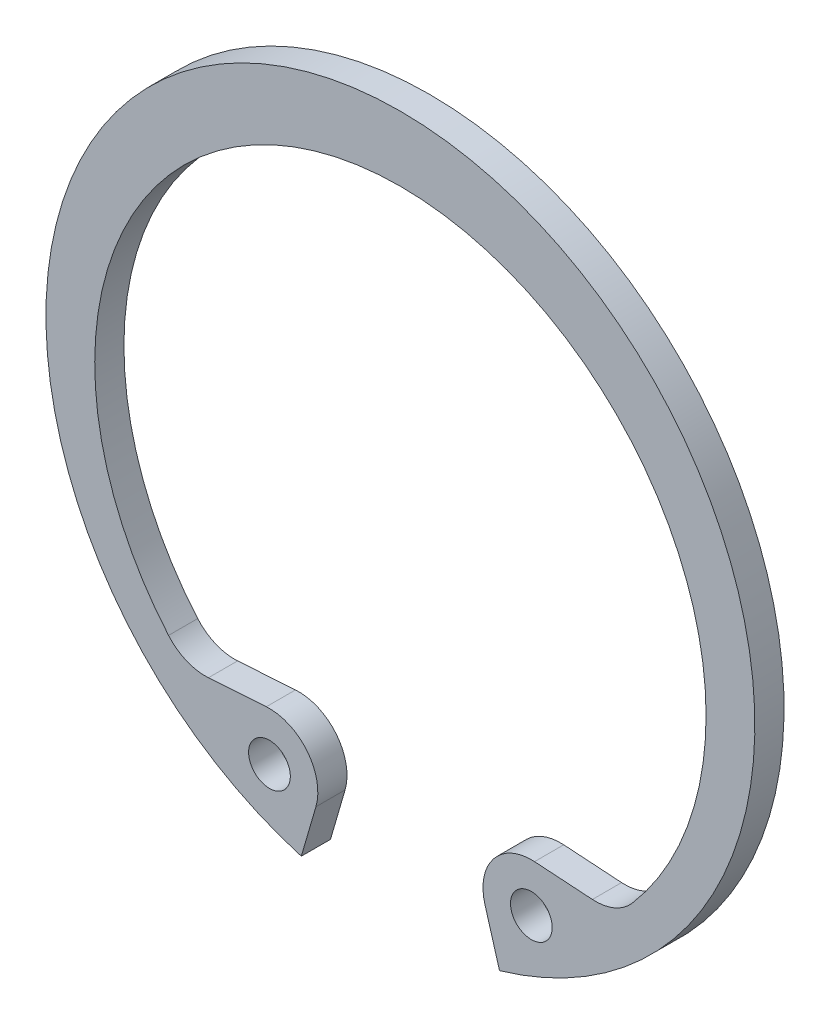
ISO-10303-21;
HEADER;
FILE_DESCRIPTION(('STEP AP214'),'2;1');
FILE_NAME('part.step','',(''),(''),'','','');
FILE_SCHEMA(('AUTOMOTIVE_DESIGN { 1 0 10303 214 1 1 1 1 }'));
ENDSEC;
DATA;
#1=APPLICATION_CONTEXT('core data for automotive mechanical design processes');
#2=APPLICATION_PROTOCOL_DEFINITION('international standard','automotive_design',2000,#1);
#3=PRODUCT_CONTEXT('',#1,'mechanical');
#4=PRODUCT('Part','Part','',(#3));
#5=PRODUCT_RELATED_PRODUCT_CATEGORY('part','',(#4));
#6=PRODUCT_DEFINITION_FORMATION('','',#4);
#7=PRODUCT_DEFINITION_CONTEXT('part definition',#1,'design');
#8=PRODUCT_DEFINITION('design','',#6,#7);
#9=PRODUCT_DEFINITION_SHAPE('','',#8);
#10=(LENGTH_UNIT() NAMED_UNIT(*) SI_UNIT(.MILLI.,.METRE.));
#11=(NAMED_UNIT(*) PLANE_ANGLE_UNIT() SI_UNIT($,.RADIAN.));
#12=(NAMED_UNIT(*) SI_UNIT($,.STERADIAN.) SOLID_ANGLE_UNIT());
#13=UNCERTAINTY_MEASURE_WITH_UNIT(LENGTH_MEASURE(1.E-05),#10,'distance_accuracy_value','');
#14=(GEOMETRIC_REPRESENTATION_CONTEXT(3) GLOBAL_UNCERTAINTY_ASSIGNED_CONTEXT((#13)) GLOBAL_UNIT_ASSIGNED_CONTEXT((#10,
#11,#12)) REPRESENTATION_CONTEXT('',''));
#15=CARTESIAN_POINT('',(0.,0.,0.));
#16=DIRECTION('',(0.,0.,1.));
#17=DIRECTION('',(1.,0.,0.));
#18=AXIS2_PLACEMENT_3D('',#15,#16,#17);
#19=CARTESIAN_POINT('',(0.,0.,1.75));
#20=DIRECTION('',(0.,0.,1.));
#21=DIRECTION('',(1.,0.,0.));
#22=AXIS2_PLACEMENT_3D('',#19,#20,#21);
#23=PLANE('',#22);
#24=CARTESIAN_POINT('',(7.85022039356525,-16.5860344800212,1.75));
#25=DIRECTION('',(0.,0.,1.));
#26=DIRECTION('',(1.,0.,0.));
#27=AXIS2_PLACEMENT_3D('',#24,#25,#26);
#28=CIRCLE('',#27,1.25);
#29=CARTESIAN_POINT('',(9.10022039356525,-16.5860344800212,1.75));
#30=VERTEX_POINT('',#29);
#31=EDGE_CURVE('E128',#30,#30,#28,.T.);
#32=ORIENTED_EDGE('',*,*,#31,.F.);
#33=EDGE_LOOP('',(#32));
#34=FACE_BOUND('',#33,.T.);
#35=CARTESIAN_POINT('',(0.,0.,1.75));
#36=DIRECTION('',(0.,0.,1.));
#37=DIRECTION('',(1.,0.,0.));
#38=AXIS2_PLACEMENT_3D('',#35,#36,#37);
#39=CIRCLE('',#38,21.25);
#40=CARTESIAN_POINT('',(5.94113009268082,-20.4025849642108,1.75));
#41=VERTEX_POINT('',#40);
#42=CARTESIAN_POINT('',(-5.94113009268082,-20.4025849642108,1.75));
#43=VERTEX_POINT('',#42);
#44=EDGE_CURVE('E150',#41,#43,#39,.T.);
#45=ORIENTED_EDGE('',*,*,#44,.T.);
#46=DIRECTION('',(0.279582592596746,0.960121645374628,0.));
#47=VECTOR('',#46,1.);
#48=CARTESIAN_POINT('',(-5.06586762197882,-17.3968239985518,1.75));
#49=LINE('',#48,#47);
#50=CARTESIAN_POINT('',(-5.06586762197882,-17.3968239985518,1.75));
#51=VERTEX_POINT('',#50);
#52=EDGE_CURVE('E123',#43,#51,#49,.T.);
#53=ORIENTED_EDGE('',*,*,#52,.T.);
#54=CARTESIAN_POINT('',(-7.85022039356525,-16.5860344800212,1.75));
#55=DIRECTION('',(0.,0.,1.));
#56=DIRECTION('',(-1.,0.,0.));
#57=AXIS2_PLACEMENT_3D('',#54,#55,#56);
#58=CIRCLE('',#57,2.90000000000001);
#59=CARTESIAN_POINT('',(-8.04063219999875,-13.6922923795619,1.75));
#60=VERTEX_POINT('',#59);
#61=EDGE_CURVE('E153',#51,#60,#58,.T.);
#62=ORIENTED_EDGE('',*,*,#61,.T.);
#63=DIRECTION('',(-0.997842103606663,-0.0656592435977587,0.));
#64=VECTOR('',#63,1.);
#65=CARTESIAN_POINT('',(-11.509657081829,-13.9205585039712,1.75));
#66=LINE('',#65,#64);
#67=CARTESIAN_POINT('',(-11.509657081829,-13.9205585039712,1.75));
#68=VERTEX_POINT('',#67);
#69=EDGE_CURVE('E155',#60,#68,#66,.T.);
#70=ORIENTED_EDGE('',*,*,#69,.T.);
#71=CARTESIAN_POINT('',(-11.7000688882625,-11.0268164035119,1.75));
#72=DIRECTION('',(0.,0.,-1.));
#73=DIRECTION('',(-1.,0.,0.));
#74=AXIS2_PLACEMENT_3D('',#71,#72,#73);
#75=CIRCLE('',#74,2.9);
#76=CARTESIAN_POINT('',(-13.8997576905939,-12.9166230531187,1.75));
#77=VERTEX_POINT('',#76);
#78=EDGE_CURVE('E157',#68,#77,#75,.T.);
#79=ORIENTED_EDGE('',*,*,#78,.T.);
#80=CARTESIAN_POINT('',(0.,-0.975,1.75));
#81=DIRECTION('',(0.,0.,-1.));
#82=DIRECTION('',(1.,0.,0.));
#83=AXIS2_PLACEMENT_3D('',#80,#81,#82);
#84=CIRCLE('',#83,18.325);
#85=CARTESIAN_POINT('',(13.8997576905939,-12.9166230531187,1.75));
#86=VERTEX_POINT('',#85);
#87=EDGE_CURVE('E159',#77,#86,#84,.T.);
#88=ORIENTED_EDGE('',*,*,#87,.T.);
#89=CARTESIAN_POINT('',(11.7000688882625,-11.0268164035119,1.75));
#90=DIRECTION('',(0.,0.,-1.));
#91=DIRECTION('',(1.,0.,0.));
#92=AXIS2_PLACEMENT_3D('',#89,#90,#91);
#93=CIRCLE('',#92,2.9);
#94=CARTESIAN_POINT('',(11.509657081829,-13.9205585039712,1.75));
#95=VERTEX_POINT('',#94);
#96=EDGE_CURVE('E161',#86,#95,#93,.T.);
#97=ORIENTED_EDGE('',*,*,#96,.T.);
#98=DIRECTION('',(-0.997842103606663,0.0656592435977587,0.));
#99=VECTOR('',#98,1.);
#100=CARTESIAN_POINT('',(11.509657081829,-13.9205585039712,1.75));
#101=LINE('',#100,#99);
#102=CARTESIAN_POINT('',(8.04063219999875,-13.6922923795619,1.75));
#103=VERTEX_POINT('',#102);
#104=EDGE_CURVE('E163',#95,#103,#101,.T.);
#105=ORIENTED_EDGE('',*,*,#104,.T.);
#106=CARTESIAN_POINT('',(7.85022039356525,-16.5860344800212,1.75));
#107=DIRECTION('',(0.,0.,1.));
#108=DIRECTION('',(1.,0.,0.));
#109=AXIS2_PLACEMENT_3D('',#106,#107,#108);
#110=CIRCLE('',#109,2.90000000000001);
#111=CARTESIAN_POINT('',(5.06586762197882,-17.3968239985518,1.75));
#112=VERTEX_POINT('',#111);
#113=EDGE_CURVE('E52',#103,#112,#110,.T.);
#114=ORIENTED_EDGE('',*,*,#113,.T.);
#115=DIRECTION('',(0.279582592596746,-0.960121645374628,0.));
#116=VECTOR('',#115,1.);
#117=CARTESIAN_POINT('',(5.06586762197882,-17.3968239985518,1.75));
#118=LINE('',#117,#116);
#119=EDGE_CURVE('E47',#112,#41,#118,.T.);
#120=ORIENTED_EDGE('',*,*,#119,.T.);
#121=EDGE_LOOP('',(#45,#53,#62,#70,#79,#88,#97,#105,#114,#120));
#122=FACE_BOUND('',#121,.T.);
#123=CARTESIAN_POINT('',(-7.85022039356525,-16.5860344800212,1.75));
#124=DIRECTION('',(0.,0.,1.));
#125=DIRECTION('',(-1.,0.,0.));
#126=AXIS2_PLACEMENT_3D('',#123,#124,#125);
#127=CIRCLE('',#126,1.25);
#128=CARTESIAN_POINT('',(-9.10022039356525,-16.5860344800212,1.75));
#129=VERTEX_POINT('',#128);
#130=EDGE_CURVE('E250',#129,#129,#127,.T.);
#131=ORIENTED_EDGE('',*,*,#130,.F.);
#132=EDGE_LOOP('',(#131));
#133=FACE_BOUND('',#132,.T.);
#134=ADVANCED_FACE('F32',(#34,#122,#133),#23,.T.);
#135=CARTESIAN_POINT('',(0.,0.,0.));
#136=DIRECTION('',(0.,0.,1.));
#137=DIRECTION('',(1.,0.,0.));
#138=AXIS2_PLACEMENT_3D('',#135,#136,#137);
#139=PLANE('',#138);
#140=CARTESIAN_POINT('',(7.85022039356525,-16.5860344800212,0.));
#141=DIRECTION('',(0.,0.,1.));
#142=DIRECTION('',(1.,0.,0.));
#143=AXIS2_PLACEMENT_3D('',#140,#141,#142);
#144=CIRCLE('',#143,1.25);
#145=CARTESIAN_POINT('',(9.10022039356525,-16.5860344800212,0.));
#146=VERTEX_POINT('',#145);
#147=EDGE_CURVE('E131',#146,#146,#144,.T.);
#148=ORIENTED_EDGE('',*,*,#147,.T.);
#149=EDGE_LOOP('',(#148));
#150=FACE_BOUND('',#149,.T.);
#151=CARTESIAN_POINT('',(0.,0.,0.));
#152=DIRECTION('',(0.,0.,1.));
#153=DIRECTION('',(1.,0.,0.));
#154=AXIS2_PLACEMENT_3D('',#151,#152,#153);
#155=CIRCLE('',#154,21.25);
#156=CARTESIAN_POINT('',(5.94113009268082,-20.4025849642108,0.));
#157=VERTEX_POINT('',#156);
#158=CARTESIAN_POINT('',(-5.94113009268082,-20.4025849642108,0.));
#159=VERTEX_POINT('',#158);
#160=EDGE_CURVE('E114',#157,#159,#155,.T.);
#161=ORIENTED_EDGE('',*,*,#160,.F.);
#162=DIRECTION('',(0.279582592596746,-0.960121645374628,0.));
#163=VECTOR('',#162,1.);
#164=CARTESIAN_POINT('',(5.06586762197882,-17.3968239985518,0.));
#165=LINE('',#164,#163);
#166=CARTESIAN_POINT('',(5.06586762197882,-17.3968239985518,0.));
#167=VERTEX_POINT('',#166);
#168=EDGE_CURVE('E148',#167,#157,#165,.T.);
#169=ORIENTED_EDGE('',*,*,#168,.F.);
#170=CARTESIAN_POINT('',(7.85022039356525,-16.5860344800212,0.));
#171=DIRECTION('',(0.,0.,1.));
#172=DIRECTION('',(1.,0.,0.));
#173=AXIS2_PLACEMENT_3D('',#170,#171,#172);
#174=CIRCLE('',#173,2.90000000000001);
#175=CARTESIAN_POINT('',(8.04063219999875,-13.6922923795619,0.));
#176=VERTEX_POINT('',#175);
#177=EDGE_CURVE('E146',#176,#167,#174,.T.);
#178=ORIENTED_EDGE('',*,*,#177,.F.);
#179=DIRECTION('',(-0.997842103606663,0.0656592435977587,0.));
#180=VECTOR('',#179,1.);
#181=CARTESIAN_POINT('',(11.509657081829,-13.9205585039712,0.));
#182=LINE('',#181,#180);
#183=CARTESIAN_POINT('',(11.509657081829,-13.9205585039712,0.));
#184=VERTEX_POINT('',#183);
#185=EDGE_CURVE('E144',#184,#176,#182,.T.);
#186=ORIENTED_EDGE('',*,*,#185,.F.);
#187=CARTESIAN_POINT('',(11.7000688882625,-11.0268164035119,0.));
#188=DIRECTION('',(0.,0.,-1.));
#189=DIRECTION('',(1.,0.,0.));
#190=AXIS2_PLACEMENT_3D('',#187,#188,#189);
#191=CIRCLE('',#190,2.9);
#192=CARTESIAN_POINT('',(13.8997576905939,-12.9166230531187,0.));
#193=VERTEX_POINT('',#192);
#194=EDGE_CURVE('E142',#193,#184,#191,.T.);
#195=ORIENTED_EDGE('',*,*,#194,.F.);
#196=CARTESIAN_POINT('',(0.,-0.975,0.));
#197=DIRECTION('',(0.,0.,-1.));
#198=DIRECTION('',(1.,0.,0.));
#199=AXIS2_PLACEMENT_3D('',#196,#197,#198);
#200=CIRCLE('',#199,18.325);
#201=CARTESIAN_POINT('',(-13.8997576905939,-12.9166230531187,0.));
#202=VERTEX_POINT('',#201);
#203=EDGE_CURVE('E140',#202,#193,#200,.T.);
#204=ORIENTED_EDGE('',*,*,#203,.F.);
#205=CARTESIAN_POINT('',(-11.7000688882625,-11.0268164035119,0.));
#206=DIRECTION('',(0.,0.,-1.));
#207=DIRECTION('',(-1.,0.,0.));
#208=AXIS2_PLACEMENT_3D('',#205,#206,#207);
#209=CIRCLE('',#208,2.9);
#210=CARTESIAN_POINT('',(-11.509657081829,-13.9205585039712,0.));
#211=VERTEX_POINT('',#210);
#212=EDGE_CURVE('E138',#211,#202,#209,.T.);
#213=ORIENTED_EDGE('',*,*,#212,.F.);
#214=DIRECTION('',(-0.997842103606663,-0.0656592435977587,0.));
#215=VECTOR('',#214,1.);
#216=CARTESIAN_POINT('',(-11.509657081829,-13.9205585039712,0.));
#217=LINE('',#216,#215);
#218=CARTESIAN_POINT('',(-8.04063219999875,-13.6922923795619,0.));
#219=VERTEX_POINT('',#218);
#220=EDGE_CURVE('E136',#219,#211,#217,.T.);
#221=ORIENTED_EDGE('',*,*,#220,.F.);
#222=CARTESIAN_POINT('',(-7.85022039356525,-16.5860344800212,0.));
#223=DIRECTION('',(0.,0.,1.));
#224=DIRECTION('',(-1.,0.,0.));
#225=AXIS2_PLACEMENT_3D('',#222,#223,#224);
#226=CIRCLE('',#225,2.90000000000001);
#227=CARTESIAN_POINT('',(-5.06586762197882,-17.3968239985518,0.));
#228=VERTEX_POINT('',#227);
#229=EDGE_CURVE('E116',#228,#219,#226,.T.);
#230=ORIENTED_EDGE('',*,*,#229,.F.);
#231=DIRECTION('',(0.279582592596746,0.960121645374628,0.));
#232=VECTOR('',#231,1.);
#233=CARTESIAN_POINT('',(-5.06586762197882,-17.3968239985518,0.));
#234=LINE('',#233,#232);
#235=EDGE_CURVE('E109',#159,#228,#234,.T.);
#236=ORIENTED_EDGE('',*,*,#235,.F.);
#237=EDGE_LOOP('',(#161,#169,#178,#186,#195,#204,#213,#221,#230,#236));
#238=FACE_BOUND('',#237,.T.);
#239=CARTESIAN_POINT('',(-7.85022039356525,-16.5860344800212,0.));
#240=DIRECTION('',(0.,0.,1.));
#241=DIRECTION('',(-1.,0.,0.));
#242=AXIS2_PLACEMENT_3D('',#239,#240,#241);
#243=CIRCLE('',#242,1.25);
#244=CARTESIAN_POINT('',(-9.10022039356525,-16.5860344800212,0.));
#245=VERTEX_POINT('',#244);
#246=EDGE_CURVE('E253',#245,#245,#243,.T.);
#247=ORIENTED_EDGE('',*,*,#246,.T.);
#248=EDGE_LOOP('',(#247));
#249=FACE_BOUND('',#248,.T.);
#250=ADVANCED_FACE('F110',(#150,#238,#249),#139,.F.);
#251=CARTESIAN_POINT('',(0.,0.,1.75));
#252=DIRECTION('',(0.,0.,-1.));
#253=DIRECTION('',(-1.,0.,0.));
#254=AXIS2_PLACEMENT_3D('',#251,#252,#253);
#255=CYLINDRICAL_SURFACE('',#254,21.25);
#256=ORIENTED_EDGE('',*,*,#160,.T.);
#257=DIRECTION('',(0.,0.,-1.));
#258=VECTOR('',#257,1.);
#259=CARTESIAN_POINT('',(-5.94113009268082,-20.4025849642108,1.75));
#260=LINE('',#259,#258);
#261=EDGE_CURVE('E11',#43,#159,#260,.T.);
#262=ORIENTED_EDGE('',*,*,#261,.F.);
#263=ORIENTED_EDGE('',*,*,#44,.F.);
#264=DIRECTION('',(0.,0.,-1.));
#265=VECTOR('',#264,1.);
#266=CARTESIAN_POINT('',(5.94113009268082,-20.4025849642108,1.75));
#267=LINE('',#266,#265);
#268=EDGE_CURVE('E127',#41,#157,#267,.T.);
#269=ORIENTED_EDGE('',*,*,#268,.T.);
#270=EDGE_LOOP('',(#256,#262,#263,#269));
#271=FACE_BOUND('',#270,.T.);
#272=ADVANCED_FACE('F34',(#271),#255,.T.);
#273=CARTESIAN_POINT('',(-5.06586762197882,-17.3968239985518,1.75));
#274=DIRECTION('',(-0.960121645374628,0.279582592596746,0.));
#275=DIRECTION('',(-0.279582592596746,-0.960121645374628,0.));
#276=AXIS2_PLACEMENT_3D('',#273,#274,#275);
#277=PLANE('',#276);
#278=ORIENTED_EDGE('',*,*,#235,.T.);
#279=DIRECTION('',(0.,0.,-1.));
#280=VECTOR('',#279,1.);
#281=CARTESIAN_POINT('',(-5.06586762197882,-17.3968239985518,1.75));
#282=LINE('',#281,#280);
#283=EDGE_CURVE('E40',#51,#228,#282,.T.);
#284=ORIENTED_EDGE('',*,*,#283,.F.);
#285=ORIENTED_EDGE('',*,*,#52,.F.);
#286=ORIENTED_EDGE('',*,*,#261,.T.);
#287=EDGE_LOOP('',(#278,#284,#285,#286));
#288=FACE_BOUND('',#287,.T.);
#289=ADVANCED_FACE('F122',(#288),#277,.F.);
#290=CARTESIAN_POINT('',(-7.85022039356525,-16.5860344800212,1.75));
#291=DIRECTION('',(0.,0.,-1.));
#292=DIRECTION('',(-1.,0.,0.));
#293=AXIS2_PLACEMENT_3D('',#290,#291,#292);
#294=CYLINDRICAL_SURFACE('',#293,2.90000000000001);
#295=ORIENTED_EDGE('',*,*,#229,.T.);
#296=DIRECTION('',(0.,0.,-1.));
#297=VECTOR('',#296,1.);
#298=CARTESIAN_POINT('',(-8.04063219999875,-13.6922923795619,1.75));
#299=LINE('',#298,#297);
#300=EDGE_CURVE('E186',#60,#219,#299,.T.);
#301=ORIENTED_EDGE('',*,*,#300,.F.);
#302=ORIENTED_EDGE('',*,*,#61,.F.);
#303=ORIENTED_EDGE('',*,*,#283,.T.);
#304=EDGE_LOOP('',(#295,#301,#302,#303));
#305=FACE_BOUND('',#304,.T.);
#306=ADVANCED_FACE('F190',(#305),#294,.T.);
#307=CARTESIAN_POINT('',(-11.509657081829,-13.9205585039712,1.75));
#308=DIRECTION('',(0.0656592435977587,-0.997842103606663,0.));
#309=DIRECTION('',(0.997842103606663,0.0656592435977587,0.));
#310=AXIS2_PLACEMENT_3D('',#307,#308,#309);
#311=PLANE('',#310);
#312=ORIENTED_EDGE('',*,*,#220,.T.);
#313=DIRECTION('',(0.,0.,-1.));
#314=VECTOR('',#313,1.);
#315=CARTESIAN_POINT('',(-11.509657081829,-13.9205585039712,1.75));
#316=LINE('',#315,#314);
#317=EDGE_CURVE('E183',#68,#211,#316,.T.);
#318=ORIENTED_EDGE('',*,*,#317,.F.);
#319=ORIENTED_EDGE('',*,*,#69,.F.);
#320=ORIENTED_EDGE('',*,*,#300,.T.);
#321=EDGE_LOOP('',(#312,#318,#319,#320));
#322=FACE_BOUND('',#321,.T.);
#323=ADVANCED_FACE('F198',(#322),#311,.F.);
#324=CARTESIAN_POINT('',(-11.7000688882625,-11.0268164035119,1.75));
#325=DIRECTION('',(0.,0.,-1.));
#326=DIRECTION('',(-1.,0.,0.));
#327=AXIS2_PLACEMENT_3D('',#324,#325,#326);
#328=CYLINDRICAL_SURFACE('',#327,2.9);
#329=ORIENTED_EDGE('',*,*,#212,.T.);
#330=DIRECTION('',(0.,0.,-1.));
#331=VECTOR('',#330,1.);
#332=CARTESIAN_POINT('',(-13.8997576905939,-12.9166230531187,1.75));
#333=LINE('',#332,#331);
#334=EDGE_CURVE('E180',#77,#202,#333,.T.);
#335=ORIENTED_EDGE('',*,*,#334,.F.);
#336=ORIENTED_EDGE('',*,*,#78,.F.);
#337=ORIENTED_EDGE('',*,*,#317,.T.);
#338=EDGE_LOOP('',(#329,#335,#336,#337));
#339=FACE_BOUND('',#338,.T.);
#340=ADVANCED_FACE('F201',(#339),#328,.F.);
#341=CARTESIAN_POINT('',(0.,-0.975,1.75));
#342=DIRECTION('',(0.,0.,-1.));
#343=DIRECTION('',(-1.,0.,0.));
#344=AXIS2_PLACEMENT_3D('',#341,#342,#343);
#345=CYLINDRICAL_SURFACE('',#344,18.325);
#346=ORIENTED_EDGE('',*,*,#203,.T.);
#347=DIRECTION('',(0.,0.,-1.));
#348=VECTOR('',#347,1.);
#349=CARTESIAN_POINT('',(13.8997576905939,-12.9166230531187,1.75));
#350=LINE('',#349,#348);
#351=EDGE_CURVE('E177',#86,#193,#350,.T.);
#352=ORIENTED_EDGE('',*,*,#351,.F.);
#353=ORIENTED_EDGE('',*,*,#87,.F.);
#354=ORIENTED_EDGE('',*,*,#334,.T.);
#355=EDGE_LOOP('',(#346,#352,#353,#354));
#356=FACE_BOUND('',#355,.T.);
#357=ADVANCED_FACE('F206',(#356),#345,.F.);
#358=CARTESIAN_POINT('',(11.7000688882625,-11.0268164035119,1.75));
#359=DIRECTION('',(0.,0.,-1.));
#360=DIRECTION('',(-1.,0.,0.));
#361=AXIS2_PLACEMENT_3D('',#358,#359,#360);
#362=CYLINDRICAL_SURFACE('',#361,2.9);
#363=ORIENTED_EDGE('',*,*,#194,.T.);
#364=DIRECTION('',(0.,0.,-1.));
#365=VECTOR('',#364,1.);
#366=CARTESIAN_POINT('',(11.509657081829,-13.9205585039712,1.75));
#367=LINE('',#366,#365);
#368=EDGE_CURVE('E174',#95,#184,#367,.T.);
#369=ORIENTED_EDGE('',*,*,#368,.F.);
#370=ORIENTED_EDGE('',*,*,#96,.F.);
#371=ORIENTED_EDGE('',*,*,#351,.T.);
#372=EDGE_LOOP('',(#363,#369,#370,#371));
#373=FACE_BOUND('',#372,.T.);
#374=ADVANCED_FACE('F212',(#373),#362,.F.);
#375=CARTESIAN_POINT('',(11.509657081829,-13.9205585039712,1.75));
#376=DIRECTION('',(-0.0656592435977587,-0.997842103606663,0.));
#377=DIRECTION('',(0.997842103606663,-0.0656592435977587,0.));
#378=AXIS2_PLACEMENT_3D('',#375,#376,#377);
#379=PLANE('',#378);
#380=ORIENTED_EDGE('',*,*,#185,.T.);
#381=DIRECTION('',(0.,0.,-1.));
#382=VECTOR('',#381,1.);
#383=CARTESIAN_POINT('',(8.04063219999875,-13.6922923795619,1.75));
#384=LINE('',#383,#382);
#385=EDGE_CURVE('E171',#103,#176,#384,.T.);
#386=ORIENTED_EDGE('',*,*,#385,.F.);
#387=ORIENTED_EDGE('',*,*,#104,.F.);
#388=ORIENTED_EDGE('',*,*,#368,.T.);
#389=EDGE_LOOP('',(#380,#386,#387,#388));
#390=FACE_BOUND('',#389,.T.);
#391=ADVANCED_FACE('F216',(#390),#379,.F.);
#392=CARTESIAN_POINT('',(7.85022039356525,-16.5860344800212,1.75));
#393=DIRECTION('',(0.,0.,-1.));
#394=DIRECTION('',(-1.,0.,0.));
#395=AXIS2_PLACEMENT_3D('',#392,#393,#394);
#396=CYLINDRICAL_SURFACE('',#395,2.90000000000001);
#397=ORIENTED_EDGE('',*,*,#177,.T.);
#398=DIRECTION('',(0.,0.,-1.));
#399=VECTOR('',#398,1.);
#400=CARTESIAN_POINT('',(5.06586762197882,-17.3968239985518,1.75));
#401=LINE('',#400,#399);
#402=EDGE_CURVE('E168',#112,#167,#401,.T.);
#403=ORIENTED_EDGE('',*,*,#402,.F.);
#404=ORIENTED_EDGE('',*,*,#113,.F.);
#405=ORIENTED_EDGE('',*,*,#385,.T.);
#406=EDGE_LOOP('',(#397,#403,#404,#405));
#407=FACE_BOUND('',#406,.T.);
#408=ADVANCED_FACE('F219',(#407),#396,.T.);
#409=CARTESIAN_POINT('',(5.06586762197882,-17.3968239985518,1.75));
#410=DIRECTION('',(0.960121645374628,0.279582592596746,0.));
#411=DIRECTION('',(-0.279582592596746,0.960121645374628,0.));
#412=AXIS2_PLACEMENT_3D('',#409,#410,#411);
#413=PLANE('',#412);
#414=ORIENTED_EDGE('',*,*,#168,.T.);
#415=ORIENTED_EDGE('',*,*,#268,.F.);
#416=ORIENTED_EDGE('',*,*,#119,.F.);
#417=ORIENTED_EDGE('',*,*,#402,.T.);
#418=EDGE_LOOP('',(#414,#415,#416,#417));
#419=FACE_BOUND('',#418,.T.);
#420=ADVANCED_FACE('F221',(#419),#413,.F.);
#421=CARTESIAN_POINT('',(7.85022039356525,-16.5860344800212,1.75));
#422=DIRECTION('',(0.,0.,-1.));
#423=DIRECTION('',(-1.,0.,0.));
#424=AXIS2_PLACEMENT_3D('',#421,#422,#423);
#425=CYLINDRICAL_SURFACE('',#424,1.25);
#426=ORIENTED_EDGE('',*,*,#31,.T.);
#427=EDGE_LOOP('',(#426));
#428=FACE_BOUND('',#427,.T.);
#429=ORIENTED_EDGE('',*,*,#147,.F.);
#430=EDGE_LOOP('',(#429));
#431=FACE_BOUND('',#430,.T.);
#432=ADVANCED_FACE('F223',(#428,#431),#425,.F.);
#433=CARTESIAN_POINT('',(-7.85022039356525,-16.5860344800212,1.75));
#434=DIRECTION('',(0.,0.,-1.));
#435=DIRECTION('',(-1.,0.,0.));
#436=AXIS2_PLACEMENT_3D('',#433,#434,#435);
#437=CYLINDRICAL_SURFACE('',#436,1.25);
#438=ORIENTED_EDGE('',*,*,#130,.T.);
#439=EDGE_LOOP('',(#438));
#440=FACE_BOUND('',#439,.T.);
#441=ORIENTED_EDGE('',*,*,#246,.F.);
#442=EDGE_LOOP('',(#441));
#443=FACE_BOUND('',#442,.T.);
#444=ADVANCED_FACE('F229',(#440,#443),#437,.F.);
#445=CLOSED_SHELL('',(#134,#250,#272,#289,#306,#323,#340,#357,#374,#391,#408,#420,#432,#444));
#446=MANIFOLD_SOLID_BREP('B2',#445);
#447=ADVANCED_BREP_SHAPE_REPRESENTATION('',(#18,#446),#14);
#448=SHAPE_DEFINITION_REPRESENTATION(#9,#447);
ENDSEC;
END-ISO-10303-21;
